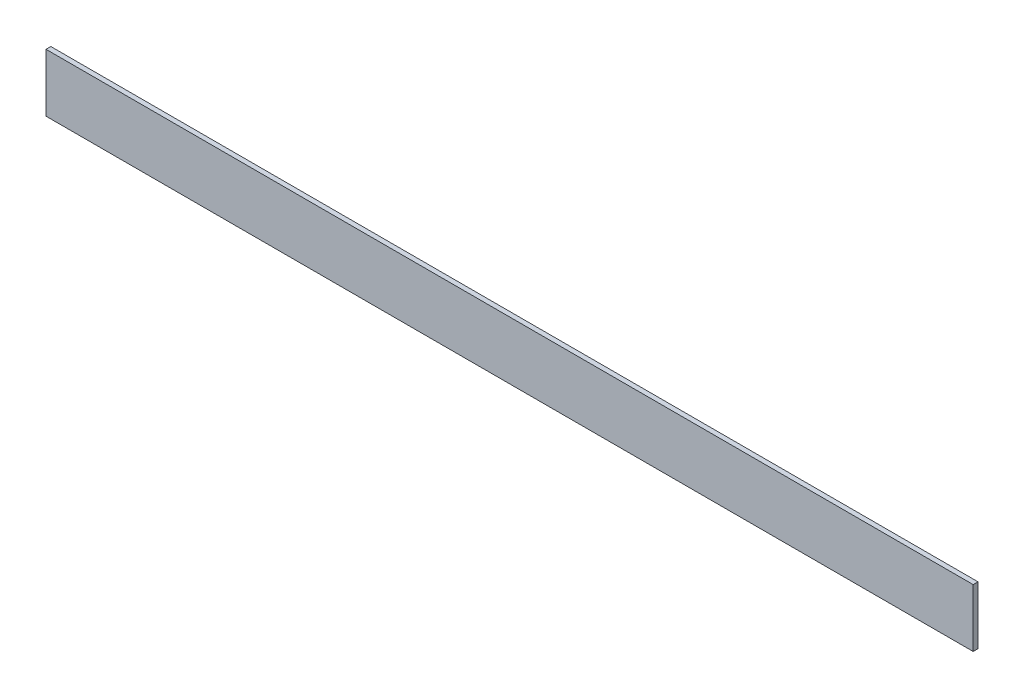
from build123d import *

# Parameters (mm, degrees)
SKETCH1_W           = 1219.2
SKETCH1_H           = 76.2
BOSS_EXTRUDE1_DEPTH = 6.35


with BuildPart() as part:
    # Sketch1 → Boss-Extrude1 (new body)
    with BuildSketch(Plane.XY):
        Rectangle(SKETCH1_W, SKETCH1_H)
    extrude(amount=BOSS_EXTRUDE1_DEPTH)


solid = part.part
